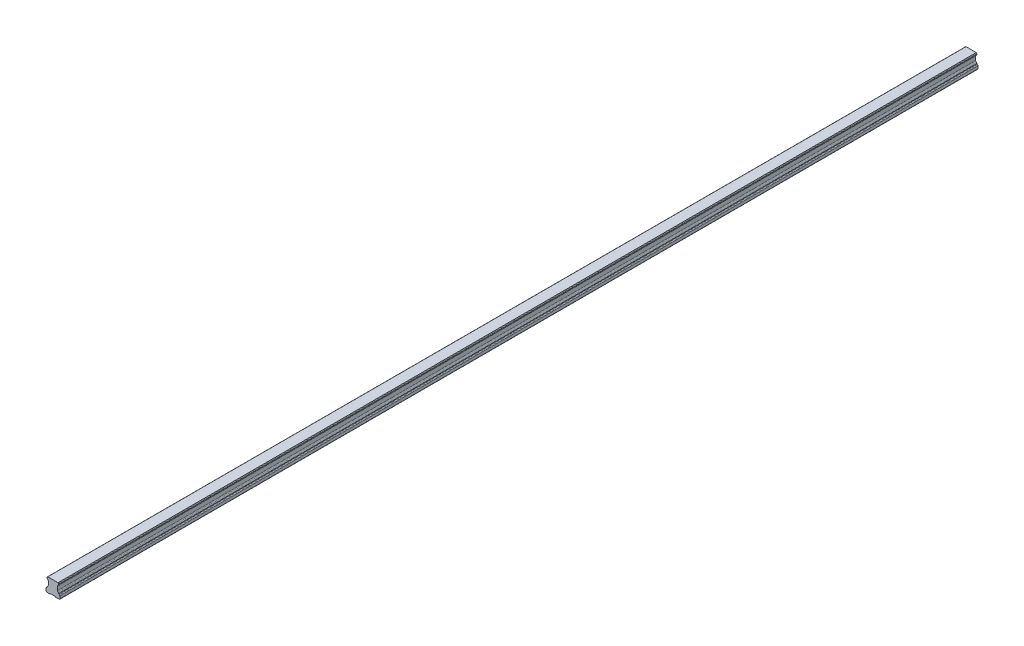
ISO-10303-21;
HEADER;
FILE_DESCRIPTION(('STEP AP214'),'2;1');
FILE_NAME('part.step','',(''),(''),'','','');
FILE_SCHEMA(('AUTOMOTIVE_DESIGN { 1 0 10303 214 1 1 1 1 }'));
ENDSEC;
DATA;
#1=APPLICATION_CONTEXT('core data for automotive mechanical design processes');
#2=APPLICATION_PROTOCOL_DEFINITION('international standard','automotive_design',2000,#1);
#3=PRODUCT_CONTEXT('',#1,'mechanical');
#4=PRODUCT('Part','Part','',(#3));
#5=PRODUCT_RELATED_PRODUCT_CATEGORY('part','',(#4));
#6=PRODUCT_DEFINITION_FORMATION('','',#4);
#7=PRODUCT_DEFINITION_CONTEXT('part definition',#1,'design');
#8=PRODUCT_DEFINITION('design','',#6,#7);
#9=PRODUCT_DEFINITION_SHAPE('','',#8);
#10=(LENGTH_UNIT() NAMED_UNIT(*) SI_UNIT(.MILLI.,.METRE.));
#11=(NAMED_UNIT(*) PLANE_ANGLE_UNIT() SI_UNIT($,.RADIAN.));
#12=(NAMED_UNIT(*) SI_UNIT($,.STERADIAN.) SOLID_ANGLE_UNIT());
#13=UNCERTAINTY_MEASURE_WITH_UNIT(LENGTH_MEASURE(1.E-05),#10,'distance_accuracy_value','');
#14=(GEOMETRIC_REPRESENTATION_CONTEXT(3) GLOBAL_UNCERTAINTY_ASSIGNED_CONTEXT((#13)) GLOBAL_UNIT_ASSIGNED_CONTEXT((#10,
#11,#12)) REPRESENTATION_CONTEXT('',''));
#15=CARTESIAN_POINT('',(0.,0.,0.));
#16=DIRECTION('',(0.,0.,1.));
#17=DIRECTION('',(1.,0.,0.));
#18=AXIS2_PLACEMENT_3D('',#15,#16,#17);
#19=CARTESIAN_POINT('',(6.84202014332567,-3.3,-1000.));
#20=DIRECTION('',(0.,-1.,0.));
#21=DIRECTION('',(1.,0.,0.));
#22=AXIS2_PLACEMENT_3D('',#19,#20,#21);
#23=PLANE('',#22);
#24=DIRECTION('',(0.,0.,1.));
#25=VECTOR('',#24,1.);
#26=CARTESIAN_POINT('',(3.,-3.3,-1000.));
#27=LINE('',#26,#25);
#28=CARTESIAN_POINT('',(3.,-3.3,-1000.));
#29=VERTEX_POINT('',#28);
#30=CARTESIAN_POINT('',(3.,-3.3,0.));
#31=VERTEX_POINT('',#30);
#32=EDGE_CURVE('E269',#29,#31,#27,.T.);
#33=ORIENTED_EDGE('',*,*,#32,.F.);
#34=DIRECTION('',(1.,0.,0.));
#35=VECTOR('',#34,1.);
#36=CARTESIAN_POINT('',(-6.84202014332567,-3.3,-1000.));
#37=LINE('',#36,#35);
#38=CARTESIAN_POINT('',(6.84202014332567,-3.3,-1000.));
#39=VERTEX_POINT('',#38);
#40=EDGE_CURVE('E460',#29,#39,#37,.T.);
#41=ORIENTED_EDGE('',*,*,#40,.T.);
#42=DIRECTION('',(0.,0.,1.));
#43=VECTOR('',#42,1.);
#44=CARTESIAN_POINT('',(6.84202014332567,-3.3,-1000.));
#45=LINE('',#44,#43);
#46=CARTESIAN_POINT('',(6.84202014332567,-3.3,0.));
#47=VERTEX_POINT('',#46);
#48=EDGE_CURVE('E368',#39,#47,#45,.T.);
#49=ORIENTED_EDGE('',*,*,#48,.T.);
#50=DIRECTION('',(1.,0.,0.));
#51=VECTOR('',#50,1.);
#52=CARTESIAN_POINT('',(6.84202014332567,-3.3,0.));
#53=LINE('',#52,#51);
#54=EDGE_CURVE('E311',#31,#47,#53,.T.);
#55=ORIENTED_EDGE('',*,*,#54,.F.);
#56=EDGE_LOOP('',(#33,#41,#49,#55));
#57=FACE_BOUND('',#56,.T.);
#58=ADVANCED_FACE('F33',(#57),#23,.T.);
#59=CARTESIAN_POINT('',(5.75000000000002,11.6,-1000.));
#60=DIRECTION('',(0.500000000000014,0.866025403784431,0.));
#61=DIRECTION('',(-0.866025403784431,0.500000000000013,0.));
#62=AXIS2_PLACEMENT_3D('',#59,#60,#61);
#63=PLANE('',#62);
#64=DIRECTION('',(-0.866025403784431,0.500000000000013,0.));
#65=VECTOR('',#64,1.);
#66=CARTESIAN_POINT('',(5.75000000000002,11.6,0.));
#67=LINE('',#66,#65);
#68=CARTESIAN_POINT('',(5.75000000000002,11.6,0.));
#69=VERTEX_POINT('',#68);
#70=CARTESIAN_POINT('',(5.57679491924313,11.7,0.));
#71=VERTEX_POINT('',#70);
#72=EDGE_CURVE('E265',#69,#71,#67,.T.);
#73=ORIENTED_EDGE('',*,*,#72,.F.);
#74=DIRECTION('',(0.,0.,1.));
#75=VECTOR('',#74,1.);
#76=CARTESIAN_POINT('',(5.75000000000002,11.6,-1000.));
#77=LINE('',#76,#75);
#78=CARTESIAN_POINT('',(5.75000000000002,11.6,-1000.));
#79=VERTEX_POINT('',#78);
#80=EDGE_CURVE('E11',#79,#69,#77,.T.);
#81=ORIENTED_EDGE('',*,*,#80,.F.);
#82=DIRECTION('',(-0.866025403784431,0.500000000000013,0.));
#83=VECTOR('',#82,1.);
#84=CARTESIAN_POINT('',(5.75000000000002,11.6,-1000.));
#85=LINE('',#84,#83);
#86=CARTESIAN_POINT('',(5.57679491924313,11.7,-1000.));
#87=VERTEX_POINT('',#86);
#88=EDGE_CURVE('E347',#79,#87,#85,.T.);
#89=ORIENTED_EDGE('',*,*,#88,.T.);
#90=DIRECTION('',(0.,0.,1.));
#91=VECTOR('',#90,1.);
#92=CARTESIAN_POINT('',(5.57679491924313,11.7,-1000.));
#93=LINE('',#92,#91);
#94=EDGE_CURVE('E37',#87,#71,#93,.T.);
#95=ORIENTED_EDGE('',*,*,#94,.T.);
#96=EDGE_LOOP('',(#73,#81,#89,#95));
#97=FACE_BOUND('',#96,.T.);
#98=ADVANCED_FACE('F35',(#97),#63,.T.);
#99=CARTESIAN_POINT('',(5.25,10.7339745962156,-1000.));
#100=DIRECTION('',(0.,0.,1.));
#101=DIRECTION('',(1.,0.,0.));
#102=AXIS2_PLACEMENT_3D('',#99,#100,#101);
#103=CYLINDRICAL_SURFACE('',#102,1.);
#104=CARTESIAN_POINT('',(5.25,10.7339745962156,0.));
#105=DIRECTION('',(0.,0.,1.));
#106=DIRECTION('',(1.,0.,0.));
#107=AXIS2_PLACEMENT_3D('',#104,#105,#106);
#108=CIRCLE('',#107,1.);
#109=CARTESIAN_POINT('',(6.25,10.7339745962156,0.));
#110=VERTEX_POINT('',#109);
#111=EDGE_CURVE('E345',#110,#69,#108,.T.);
#112=ORIENTED_EDGE('',*,*,#111,.F.);
#113=DIRECTION('',(0.,0.,1.));
#114=VECTOR('',#113,1.);
#115=CARTESIAN_POINT('',(6.25,10.7339745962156,-1000.));
#116=LINE('',#115,#114);
#117=CARTESIAN_POINT('',(6.25,10.7339745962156,-1000.));
#118=VERTEX_POINT('',#117);
#119=EDGE_CURVE('E42',#118,#110,#116,.T.);
#120=ORIENTED_EDGE('',*,*,#119,.F.);
#121=CARTESIAN_POINT('',(5.25,10.7339745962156,-1000.));
#122=DIRECTION('',(0.,0.,1.));
#123=DIRECTION('',(1.,0.,0.));
#124=AXIS2_PLACEMENT_3D('',#121,#122,#123);
#125=CIRCLE('',#124,1.);
#126=EDGE_CURVE('E255',#118,#79,#125,.T.);
#127=ORIENTED_EDGE('',*,*,#126,.T.);
#128=ORIENTED_EDGE('',*,*,#80,.T.);
#129=EDGE_LOOP('',(#112,#120,#127,#128));
#130=FACE_BOUND('',#129,.T.);
#131=ADVANCED_FACE('F404',(#130),#103,.T.);
#132=CARTESIAN_POINT('',(6.25,10.2339745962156,-1000.));
#133=DIRECTION('',(1.,0.,0.));
#134=DIRECTION('',(0.,1.,0.));
#135=AXIS2_PLACEMENT_3D('',#132,#133,#134);
#136=PLANE('',#135);
#137=DIRECTION('',(0.,1.,0.));
#138=VECTOR('',#137,1.);
#139=CARTESIAN_POINT('',(6.25,10.2339745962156,0.));
#140=LINE('',#139,#138);
#141=CARTESIAN_POINT('',(6.25,10.2339745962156,0.));
#142=VERTEX_POINT('',#141);
#143=EDGE_CURVE('E241',#142,#110,#140,.T.);
#144=ORIENTED_EDGE('',*,*,#143,.F.);
#145=DIRECTION('',(0.,0.,1.));
#146=VECTOR('',#145,1.);
#147=CARTESIAN_POINT('',(6.25,10.2339745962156,-1000.));
#148=LINE('',#147,#146);
#149=CARTESIAN_POINT('',(6.25,10.2339745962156,-1000.));
#150=VERTEX_POINT('',#149);
#151=EDGE_CURVE('E235',#150,#142,#148,.T.);
#152=ORIENTED_EDGE('',*,*,#151,.F.);
#153=DIRECTION('',(0.,1.,0.));
#154=VECTOR('',#153,1.);
#155=CARTESIAN_POINT('',(6.25,10.2339745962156,-1000.));
#156=LINE('',#155,#154);
#157=EDGE_CURVE('E238',#150,#118,#156,.T.);
#158=ORIENTED_EDGE('',*,*,#157,.T.);
#159=ORIENTED_EDGE('',*,*,#119,.T.);
#160=EDGE_LOOP('',(#144,#152,#158,#159));
#161=FACE_BOUND('',#160,.T.);
#162=ADVANCED_FACE('F237',(#161),#136,.T.);
#163=CARTESIAN_POINT('',(5.25,10.2339745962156,-1000.));
#164=DIRECTION('',(0.,0.,1.));
#165=DIRECTION('',(1.,0.,0.));
#166=AXIS2_PLACEMENT_3D('',#163,#164,#165);
#167=CYLINDRICAL_SURFACE('',#166,1.);
#168=CARTESIAN_POINT('',(5.25,10.2339745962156,0.));
#169=DIRECTION('',(0.,0.,1.));
#170=DIRECTION('',(1.,0.,0.));
#171=AXIS2_PLACEMENT_3D('',#168,#169,#170);
#172=CIRCLE('',#171,1.);
#173=CARTESIAN_POINT('',(5.69444444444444,9.33816817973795,0.));
#174=VERTEX_POINT('',#173);
#175=EDGE_CURVE('E342',#174,#142,#172,.T.);
#176=ORIENTED_EDGE('',*,*,#175,.F.);
#177=DIRECTION('',(0.,0.,1.));
#178=VECTOR('',#177,1.);
#179=CARTESIAN_POINT('',(5.69444444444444,9.33816817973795,-1000.));
#180=LINE('',#179,#178);
#181=CARTESIAN_POINT('',(5.69444444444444,9.33816817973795,-1000.));
#182=VERTEX_POINT('',#181);
#183=EDGE_CURVE('E246',#182,#174,#180,.T.);
#184=ORIENTED_EDGE('',*,*,#183,.F.);
#185=CARTESIAN_POINT('',(5.25,10.2339745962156,-1000.));
#186=DIRECTION('',(0.,0.,1.));
#187=DIRECTION('',(1.,0.,0.));
#188=AXIS2_PLACEMENT_3D('',#185,#186,#187);
#189=CIRCLE('',#188,1.);
#190=EDGE_CURVE('E253',#182,#150,#189,.T.);
#191=ORIENTED_EDGE('',*,*,#190,.T.);
#192=ORIENTED_EDGE('',*,*,#151,.T.);
#193=EDGE_LOOP('',(#176,#184,#191,#192));
#194=FACE_BOUND('',#193,.T.);
#195=ADVANCED_FACE('F257',(#194),#167,.T.);
#196=CARTESIAN_POINT('',(6.25,8.21841015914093,-1000.));
#197=DIRECTION('',(0.,0.,1.));
#198=DIRECTION('',(1.,0.,0.));
#199=AXIS2_PLACEMENT_3D('',#196,#197,#198);
#200=CYLINDRICAL_SURFACE('',#199,1.25);
#201=CARTESIAN_POINT('',(6.25,8.21841015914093,0.));
#202=DIRECTION('',(0.,0.,-1.));
#203=DIRECTION('',(1.,0.,0.));
#204=AXIS2_PLACEMENT_3D('',#201,#202,#203);
#205=CIRCLE('',#204,1.25);
#206=CARTESIAN_POINT('',(5.,8.21841015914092,0.));
#207=VERTEX_POINT('',#206);
#208=EDGE_CURVE('E339',#207,#174,#205,.T.);
#209=ORIENTED_EDGE('',*,*,#208,.F.);
#210=DIRECTION('',(0.,0.,1.));
#211=VECTOR('',#210,1.);
#212=CARTESIAN_POINT('',(5.,8.21841015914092,-1000.));
#213=LINE('',#212,#211);
#214=CARTESIAN_POINT('',(5.,8.21841015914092,-1000.));
#215=VERTEX_POINT('',#214);
#216=EDGE_CURVE('E351',#215,#207,#213,.T.);
#217=ORIENTED_EDGE('',*,*,#216,.F.);
#218=CARTESIAN_POINT('',(6.25,8.21841015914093,-1000.));
#219=DIRECTION('',(0.,0.,-1.));
#220=DIRECTION('',(1.,0.,0.));
#221=AXIS2_PLACEMENT_3D('',#218,#219,#220);
#222=CIRCLE('',#221,1.25);
#223=EDGE_CURVE('E258',#215,#182,#222,.T.);
#224=ORIENTED_EDGE('',*,*,#223,.T.);
#225=ORIENTED_EDGE('',*,*,#183,.T.);
#226=EDGE_LOOP('',(#209,#217,#224,#225));
#227=FACE_BOUND('',#226,.T.);
#228=ADVANCED_FACE('F852',(#227),#200,.F.);
#229=CARTESIAN_POINT('',(5.,4.02023384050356,-1000.));
#230=DIRECTION('',(1.,0.,0.));
#231=DIRECTION('',(0.,0.,-1.));
#232=AXIS2_PLACEMENT_3D('',#229,#230,#231);
#233=PLANE('',#232);
#234=DIRECTION('',(0.,1.,0.));
#235=VECTOR('',#234,1.);
#236=CARTESIAN_POINT('',(5.,4.02023384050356,0.));
#237=LINE('',#236,#235);
#238=CARTESIAN_POINT('',(5.,4.02023384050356,0.));
#239=VERTEX_POINT('',#238);
#240=EDGE_CURVE('E336',#239,#207,#237,.T.);
#241=ORIENTED_EDGE('',*,*,#240,.F.);
#242=DIRECTION('',(0.,0.,1.));
#243=VECTOR('',#242,1.);
#244=CARTESIAN_POINT('',(5.,4.02023384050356,-1000.));
#245=LINE('',#244,#243);
#246=CARTESIAN_POINT('',(5.,4.02023384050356,-1000.));
#247=VERTEX_POINT('',#246);
#248=EDGE_CURVE('E353',#247,#239,#245,.T.);
#249=ORIENTED_EDGE('',*,*,#248,.F.);
#250=DIRECTION('',(0.,1.,0.));
#251=VECTOR('',#250,1.);
#252=CARTESIAN_POINT('',(5.,4.02023384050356,-1000.));
#253=LINE('',#252,#251);
#254=EDGE_CURVE('E260',#247,#215,#253,.T.);
#255=ORIENTED_EDGE('',*,*,#254,.T.);
#256=ORIENTED_EDGE('',*,*,#216,.T.);
#257=EDGE_LOOP('',(#241,#249,#255,#256));
#258=FACE_BOUND('',#257,.T.);
#259=ADVANCED_FACE('F487',(#258),#233,.T.);
#260=CARTESIAN_POINT('',(6.25,4.02023384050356,-1000.));
#261=DIRECTION('',(0.,0.,1.));
#262=DIRECTION('',(1.,0.,0.));
#263=AXIS2_PLACEMENT_3D('',#260,#261,#262);
#264=CYLINDRICAL_SURFACE('',#263,1.25);
#265=CARTESIAN_POINT('',(6.25,4.02023384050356,0.));
#266=DIRECTION('',(0.,0.,-1.));
#267=DIRECTION('',(1.,0.,0.));
#268=AXIS2_PLACEMENT_3D('',#265,#266,#267);
#269=CIRCLE('',#268,1.25);
#270=CARTESIAN_POINT('',(5.625,2.93770208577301,0.));
#271=VERTEX_POINT('',#270);
#272=EDGE_CURVE('E333',#271,#239,#269,.T.);
#273=ORIENTED_EDGE('',*,*,#272,.F.);
#274=DIRECTION('',(0.,0.,1.));
#275=VECTOR('',#274,1.);
#276=CARTESIAN_POINT('',(5.625,2.93770208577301,-1000.));
#277=LINE('',#276,#275);
#278=CARTESIAN_POINT('',(5.625,2.93770208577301,-1000.));
#279=VERTEX_POINT('',#278);
#280=EDGE_CURVE('E355',#279,#271,#277,.T.);
#281=ORIENTED_EDGE('',*,*,#280,.F.);
#282=CARTESIAN_POINT('',(6.25,4.02023384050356,-1000.));
#283=DIRECTION('',(0.,0.,-1.));
#284=DIRECTION('',(1.,0.,0.));
#285=AXIS2_PLACEMENT_3D('',#282,#283,#284);
#286=CIRCLE('',#285,1.25);
#287=EDGE_CURVE('E481',#279,#247,#286,.T.);
#288=ORIENTED_EDGE('',*,*,#287,.T.);
#289=ORIENTED_EDGE('',*,*,#248,.T.);
#290=EDGE_LOOP('',(#273,#281,#288,#289));
#291=FACE_BOUND('',#290,.T.);
#292=ADVANCED_FACE('F493',(#291),#264,.F.);
#293=CARTESIAN_POINT('',(5.,1.85517033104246,-1000.));
#294=DIRECTION('',(0.,0.,1.));
#295=DIRECTION('',(1.,0.,0.));
#296=AXIS2_PLACEMENT_3D('',#293,#294,#295);
#297=CYLINDRICAL_SURFACE('',#296,1.25);
#298=CARTESIAN_POINT('',(5.,1.85517033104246,0.));
#299=DIRECTION('',(0.,0.,1.));
#300=DIRECTION('',(1.,0.,0.));
#301=AXIS2_PLACEMENT_3D('',#298,#299,#300);
#302=CIRCLE('',#301,1.25);
#303=CARTESIAN_POINT('',(6.25,1.85517033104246,0.));
#304=VERTEX_POINT('',#303);
#305=EDGE_CURVE('E330',#304,#271,#302,.T.);
#306=ORIENTED_EDGE('',*,*,#305,.F.);
#307=DIRECTION('',(0.,0.,1.));
#308=VECTOR('',#307,1.);
#309=CARTESIAN_POINT('',(6.25,1.85517033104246,-1000.));
#310=LINE('',#309,#308);
#311=CARTESIAN_POINT('',(6.25,1.85517033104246,-1000.));
#312=VERTEX_POINT('',#311);
#313=EDGE_CURVE('E357',#312,#304,#310,.T.);
#314=ORIENTED_EDGE('',*,*,#313,.F.);
#315=CARTESIAN_POINT('',(5.,1.85517033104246,-1000.));
#316=DIRECTION('',(0.,0.,1.));
#317=DIRECTION('',(1.,0.,0.));
#318=AXIS2_PLACEMENT_3D('',#315,#316,#317);
#319=CIRCLE('',#318,1.25);
#320=EDGE_CURVE('E478',#312,#279,#319,.T.);
#321=ORIENTED_EDGE('',*,*,#320,.T.);
#322=ORIENTED_EDGE('',*,*,#280,.T.);
#323=EDGE_LOOP('',(#306,#314,#321,#322));
#324=FACE_BOUND('',#323,.T.);
#325=ADVANCED_FACE('F496',(#324),#297,.T.);
#326=CARTESIAN_POINT('',(6.25,1.35517033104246,-1000.));
#327=DIRECTION('',(1.,0.,0.));
#328=DIRECTION('',(0.,0.,-1.));
#329=AXIS2_PLACEMENT_3D('',#326,#327,#328);
#330=PLANE('',#329);
#331=DIRECTION('',(0.,1.,0.));
#332=VECTOR('',#331,1.);
#333=CARTESIAN_POINT('',(6.25,1.35517033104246,0.));
#334=LINE('',#333,#332);
#335=CARTESIAN_POINT('',(6.25,1.35517033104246,0.));
#336=VERTEX_POINT('',#335);
#337=EDGE_CURVE('E327',#336,#304,#334,.T.);
#338=ORIENTED_EDGE('',*,*,#337,.F.);
#339=DIRECTION('',(0.,0.,1.));
#340=VECTOR('',#339,1.);
#341=CARTESIAN_POINT('',(6.25,1.35517033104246,-1000.));
#342=LINE('',#341,#340);
#343=CARTESIAN_POINT('',(6.25,1.35517033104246,-1000.));
#344=VERTEX_POINT('',#343);
#345=EDGE_CURVE('E359',#344,#336,#342,.T.);
#346=ORIENTED_EDGE('',*,*,#345,.F.);
#347=DIRECTION('',(0.,1.,0.));
#348=VECTOR('',#347,1.);
#349=CARTESIAN_POINT('',(6.25,1.35517033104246,-1000.));
#350=LINE('',#349,#348);
#351=EDGE_CURVE('E475',#344,#312,#350,.T.);
#352=ORIENTED_EDGE('',*,*,#351,.T.);
#353=ORIENTED_EDGE('',*,*,#313,.T.);
#354=EDGE_LOOP('',(#338,#346,#352,#353));
#355=FACE_BOUND('',#354,.T.);
#356=ADVANCED_FACE('F501',(#355),#330,.T.);
#357=CARTESIAN_POINT('',(6.84202014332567,1.13969262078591,-1000.));
#358=DIRECTION('',(0.342020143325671,0.939692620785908,0.));
#359=DIRECTION('',(-0.939692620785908,0.342020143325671,0.));
#360=AXIS2_PLACEMENT_3D('',#357,#358,#359);
#361=PLANE('',#360);
#362=DIRECTION('',(-0.939692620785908,0.342020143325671,0.));
#363=VECTOR('',#362,1.);
#364=CARTESIAN_POINT('',(6.84202014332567,1.13969262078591,0.));
#365=LINE('',#364,#363);
#366=CARTESIAN_POINT('',(6.84202014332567,1.13969262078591,0.));
#367=VERTEX_POINT('',#366);
#368=EDGE_CURVE('E324',#367,#336,#365,.T.);
#369=ORIENTED_EDGE('',*,*,#368,.F.);
#370=DIRECTION('',(0.,0.,1.));
#371=VECTOR('',#370,1.);
#372=CARTESIAN_POINT('',(6.84202014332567,1.13969262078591,-1000.));
#373=LINE('',#372,#371);
#374=CARTESIAN_POINT('',(6.84202014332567,1.13969262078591,-1000.));
#375=VERTEX_POINT('',#374);
#376=EDGE_CURVE('E361',#375,#367,#373,.T.);
#377=ORIENTED_EDGE('',*,*,#376,.F.);
#378=DIRECTION('',(-0.939692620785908,0.342020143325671,0.));
#379=VECTOR('',#378,1.);
#380=CARTESIAN_POINT('',(6.84202014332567,1.13969262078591,-1000.));
#381=LINE('',#380,#379);
#382=EDGE_CURVE('E472',#375,#344,#381,.T.);
#383=ORIENTED_EDGE('',*,*,#382,.T.);
#384=ORIENTED_EDGE('',*,*,#345,.T.);
#385=EDGE_LOOP('',(#369,#377,#383,#384));
#386=FACE_BOUND('',#385,.T.);
#387=ADVANCED_FACE('F504',(#386),#361,.T.);
#388=CARTESIAN_POINT('',(6.5,0.2,-1000.));
#389=DIRECTION('',(0.,0.,1.));
#390=DIRECTION('',(1.,0.,0.));
#391=AXIS2_PLACEMENT_3D('',#388,#389,#390);
#392=CYLINDRICAL_SURFACE('',#391,1.);
#393=CARTESIAN_POINT('',(6.5,0.2,0.));
#394=DIRECTION('',(0.,0.,1.));
#395=DIRECTION('',(1.,0.,0.));
#396=AXIS2_PLACEMENT_3D('',#393,#394,#395);
#397=CIRCLE('',#396,1.);
#398=CARTESIAN_POINT('',(7.5,0.2,0.));
#399=VERTEX_POINT('',#398);
#400=EDGE_CURVE('E321',#399,#367,#397,.T.);
#401=ORIENTED_EDGE('',*,*,#400,.F.);
#402=DIRECTION('',(0.,0.,1.));
#403=VECTOR('',#402,1.);
#404=CARTESIAN_POINT('',(7.5,0.2,-1000.));
#405=LINE('',#404,#403);
#406=CARTESIAN_POINT('',(7.5,0.2,-1000.));
#407=VERTEX_POINT('',#406);
#408=EDGE_CURVE('E363',#407,#399,#405,.T.);
#409=ORIENTED_EDGE('',*,*,#408,.F.);
#410=CARTESIAN_POINT('',(6.5,0.2,-1000.));
#411=DIRECTION('',(0.,0.,1.));
#412=DIRECTION('',(1.,0.,0.));
#413=AXIS2_PLACEMENT_3D('',#410,#411,#412);
#414=CIRCLE('',#413,1.);
#415=EDGE_CURVE('E469',#407,#375,#414,.T.);
#416=ORIENTED_EDGE('',*,*,#415,.T.);
#417=ORIENTED_EDGE('',*,*,#376,.T.);
#418=EDGE_LOOP('',(#401,#409,#416,#417));
#419=FACE_BOUND('',#418,.T.);
#420=ADVANCED_FACE('F510',(#419),#392,.T.);
#421=CARTESIAN_POINT('',(7.5,0.,-1000.));
#422=DIRECTION('',(1.,0.,0.));
#423=DIRECTION('',(0.,1.,0.));
#424=AXIS2_PLACEMENT_3D('',#421,#422,#423);
#425=PLANE('',#424);
#426=DIRECTION('',(0.,1.,0.));
#427=VECTOR('',#426,1.);
#428=CARTESIAN_POINT('',(7.5,0.,0.));
#429=LINE('',#428,#427);
#430=CARTESIAN_POINT('',(7.5,-2.64202014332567,0.));
#431=VERTEX_POINT('',#430);
#432=EDGE_CURVE('E318',#431,#399,#429,.T.);
#433=ORIENTED_EDGE('',*,*,#432,.F.);
#434=DIRECTION('',(0.,0.,1.));
#435=VECTOR('',#434,1.);
#436=CARTESIAN_POINT('',(7.5,-2.64202014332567,-1000.));
#437=LINE('',#436,#435);
#438=CARTESIAN_POINT('',(7.5,-2.64202014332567,-1000.));
#439=VERTEX_POINT('',#438);
#440=EDGE_CURVE('E365',#439,#431,#437,.T.);
#441=ORIENTED_EDGE('',*,*,#440,.F.);
#442=DIRECTION('',(0.,1.,0.));
#443=VECTOR('',#442,1.);
#444=CARTESIAN_POINT('',(7.5,0.,-1000.));
#445=LINE('',#444,#443);
#446=EDGE_CURVE('E463',#439,#407,#445,.T.);
#447=ORIENTED_EDGE('',*,*,#446,.T.);
#448=ORIENTED_EDGE('',*,*,#408,.T.);
#449=EDGE_LOOP('',(#433,#441,#447,#448));
#450=FACE_BOUND('',#449,.T.);
#451=ADVANCED_FACE('F432',(#450),#425,.T.);
#452=CARTESIAN_POINT('',(6.84202014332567,-2.64202014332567,-1000.));
#453=DIRECTION('',(0.,0.,1.));
#454=DIRECTION('',(1.,0.,0.));
#455=AXIS2_PLACEMENT_3D('',#452,#453,#454);
#456=CYLINDRICAL_SURFACE('',#455,0.657979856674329);
#457=CARTESIAN_POINT('',(6.84202014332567,-2.64202014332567,0.));
#458=DIRECTION('',(0.,0.,1.));
#459=DIRECTION('',(1.,0.,0.));
#460=AXIS2_PLACEMENT_3D('',#457,#458,#459);
#461=CIRCLE('',#460,0.657979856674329);
#462=EDGE_CURVE('E315',#47,#431,#461,.T.);
#463=ORIENTED_EDGE('',*,*,#462,.F.);
#464=ORIENTED_EDGE('',*,*,#48,.F.);
#465=CARTESIAN_POINT('',(6.84202014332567,-2.64202014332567,-1000.));
#466=DIRECTION('',(0.,0.,1.));
#467=DIRECTION('',(1.,0.,0.));
#468=AXIS2_PLACEMENT_3D('',#465,#466,#467);
#469=CIRCLE('',#468,0.657979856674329);
#470=EDGE_CURVE('E459',#39,#439,#469,.T.);
#471=ORIENTED_EDGE('',*,*,#470,.T.);
#472=ORIENTED_EDGE('',*,*,#440,.T.);
#473=EDGE_LOOP('',(#463,#464,#471,#472));
#474=FACE_BOUND('',#473,.T.);
#475=ADVANCED_FACE('F424',(#474),#456,.T.);
#476=DIRECTION('',(0.,0.,1.));
#477=VECTOR('',#476,1.);
#478=CARTESIAN_POINT('',(-3.,-3.30000000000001,-1000.));
#479=LINE('',#478,#477);
#480=CARTESIAN_POINT('',(-3.,-3.30000000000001,-1000.));
#481=VERTEX_POINT('',#480);
#482=CARTESIAN_POINT('',(-3.,-3.30000000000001,0.));
#483=VERTEX_POINT('',#482);
#484=EDGE_CURVE('E438',#481,#483,#479,.T.);
#485=ORIENTED_EDGE('',*,*,#484,.T.);
#486=CARTESIAN_POINT('',(-6.84202014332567,-3.3,0.));
#487=VERTEX_POINT('',#486);
#488=EDGE_CURVE('E312',#487,#483,#53,.T.);
#489=ORIENTED_EDGE('',*,*,#488,.F.);
#490=DIRECTION('',(0.,0.,1.));
#491=VECTOR('',#490,1.);
#492=CARTESIAN_POINT('',(-6.84202014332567,-3.3,-1000.));
#493=LINE('',#492,#491);
#494=CARTESIAN_POINT('',(-6.84202014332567,-3.3,-1000.));
#495=VERTEX_POINT('',#494);
#496=EDGE_CURVE('E371',#495,#487,#493,.T.);
#497=ORIENTED_EDGE('',*,*,#496,.F.);
#498=EDGE_CURVE('E441',#495,#481,#37,.T.);
#499=ORIENTED_EDGE('',*,*,#498,.T.);
#500=EDGE_LOOP('',(#485,#489,#497,#499));
#501=FACE_BOUND('',#500,.T.);
#502=ADVANCED_FACE('F416',(#501),#23,.T.);
#503=CARTESIAN_POINT('',(-6.84202014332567,-2.64202014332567,-1000.));
#504=DIRECTION('',(0.,0.,1.));
#505=DIRECTION('',(1.,0.,0.));
#506=AXIS2_PLACEMENT_3D('',#503,#504,#505);
#507=CYLINDRICAL_SURFACE('',#506,0.657979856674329);
#508=CARTESIAN_POINT('',(-6.84202014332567,-2.64202014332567,0.));
#509=DIRECTION('',(0.,0.,1.));
#510=DIRECTION('',(-1.,0.,0.));
#511=AXIS2_PLACEMENT_3D('',#508,#509,#510);
#512=CIRCLE('',#511,0.657979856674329);
#513=CARTESIAN_POINT('',(-7.5,-2.64202014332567,0.));
#514=VERTEX_POINT('',#513);
#515=EDGE_CURVE('E308',#514,#487,#512,.T.);
#516=ORIENTED_EDGE('',*,*,#515,.F.);
#517=DIRECTION('',(0.,0.,1.));
#518=VECTOR('',#517,1.);
#519=CARTESIAN_POINT('',(-7.5,-2.64202014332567,-1000.));
#520=LINE('',#519,#518);
#521=CARTESIAN_POINT('',(-7.5,-2.64202014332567,-1000.));
#522=VERTEX_POINT('',#521);
#523=EDGE_CURVE('E374',#522,#514,#520,.T.);
#524=ORIENTED_EDGE('',*,*,#523,.F.);
#525=CARTESIAN_POINT('',(-6.84202014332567,-2.64202014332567,-1000.));
#526=DIRECTION('',(0.,0.,1.));
#527=DIRECTION('',(-1.,0.,0.));
#528=AXIS2_PLACEMENT_3D('',#525,#526,#527);
#529=CIRCLE('',#528,0.657979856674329);
#530=EDGE_CURVE('E455',#522,#495,#529,.T.);
#531=ORIENTED_EDGE('',*,*,#530,.T.);
#532=ORIENTED_EDGE('',*,*,#496,.T.);
#533=EDGE_LOOP('',(#516,#524,#531,#532));
#534=FACE_BOUND('',#533,.T.);
#535=ADVANCED_FACE('F423',(#534),#507,.T.);
#536=CARTESIAN_POINT('',(-7.5,0.,-1000.));
#537=DIRECTION('',(-1.,0.,0.));
#538=DIRECTION('',(0.,-1.,0.));
#539=AXIS2_PLACEMENT_3D('',#536,#537,#538);
#540=PLANE('',#539);
#541=DIRECTION('',(0.,-1.,0.));
#542=VECTOR('',#541,1.);
#543=CARTESIAN_POINT('',(-7.5,0.,0.));
#544=LINE('',#543,#542);
#545=CARTESIAN_POINT('',(-7.5,0.199999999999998,0.));
#546=VERTEX_POINT('',#545);
#547=EDGE_CURVE('E305',#546,#514,#544,.T.);
#548=ORIENTED_EDGE('',*,*,#547,.F.);
#549=DIRECTION('',(0.,0.,1.));
#550=VECTOR('',#549,1.);
#551=CARTESIAN_POINT('',(-7.5,0.199999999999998,-1000.));
#552=LINE('',#551,#550);
#553=CARTESIAN_POINT('',(-7.5,0.199999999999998,-1000.));
#554=VERTEX_POINT('',#553);
#555=EDGE_CURVE('E376',#554,#546,#552,.T.);
#556=ORIENTED_EDGE('',*,*,#555,.F.);
#557=DIRECTION('',(0.,-1.,0.));
#558=VECTOR('',#557,1.);
#559=CARTESIAN_POINT('',(-7.5,0.,-1000.));
#560=LINE('',#559,#558);
#561=EDGE_CURVE('E577',#554,#522,#560,.T.);
#562=ORIENTED_EDGE('',*,*,#561,.T.);
#563=ORIENTED_EDGE('',*,*,#523,.T.);
#564=EDGE_LOOP('',(#548,#556,#562,#563));
#565=FACE_BOUND('',#564,.T.);
#566=ADVANCED_FACE('F430',(#565),#540,.T.);
#567=CARTESIAN_POINT('',(-6.5,0.199999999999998,-1000.));
#568=DIRECTION('',(0.,0.,1.));
#569=DIRECTION('',(1.,0.,0.));
#570=AXIS2_PLACEMENT_3D('',#567,#568,#569);
#571=CYLINDRICAL_SURFACE('',#570,1.);
#572=CARTESIAN_POINT('',(-6.5,0.199999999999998,0.));
#573=DIRECTION('',(0.,0.,1.));
#574=DIRECTION('',(-1.,0.,0.));
#575=AXIS2_PLACEMENT_3D('',#572,#573,#574);
#576=CIRCLE('',#575,1.);
#577=CARTESIAN_POINT('',(-6.84202014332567,1.13969262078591,0.));
#578=VERTEX_POINT('',#577);
#579=EDGE_CURVE('E302',#578,#546,#576,.T.);
#580=ORIENTED_EDGE('',*,*,#579,.F.);
#581=DIRECTION('',(0.,0.,1.));
#582=VECTOR('',#581,1.);
#583=CARTESIAN_POINT('',(-6.84202014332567,1.13969262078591,-1000.));
#584=LINE('',#583,#582);
#585=CARTESIAN_POINT('',(-6.84202014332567,1.13969262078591,-1000.));
#586=VERTEX_POINT('',#585);
#587=EDGE_CURVE('E379',#586,#578,#584,.T.);
#588=ORIENTED_EDGE('',*,*,#587,.F.);
#589=CARTESIAN_POINT('',(-6.5,0.199999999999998,-1000.));
#590=DIRECTION('',(0.,0.,1.));
#591=DIRECTION('',(-1.,0.,0.));
#592=AXIS2_PLACEMENT_3D('',#589,#590,#591);
#593=CIRCLE('',#592,1.);
#594=EDGE_CURVE('E575',#586,#554,#593,.T.);
#595=ORIENTED_EDGE('',*,*,#594,.T.);
#596=ORIENTED_EDGE('',*,*,#555,.T.);
#597=EDGE_LOOP('',(#580,#588,#595,#596));
#598=FACE_BOUND('',#597,.T.);
#599=ADVANCED_FACE('F583',(#598),#571,.T.);
#600=CARTESIAN_POINT('',(-6.84202014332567,1.13969262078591,-1000.));
#601=DIRECTION('',(-0.342020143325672,0.939692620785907,0.));
#602=DIRECTION('',(-0.939692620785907,-0.342020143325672,0.));
#603=AXIS2_PLACEMENT_3D('',#600,#601,#602);
#604=PLANE('',#603);
#605=DIRECTION('',(-0.939692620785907,-0.342020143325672,0.));
#606=VECTOR('',#605,1.);
#607=CARTESIAN_POINT('',(-6.84202014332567,1.13969262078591,0.));
#608=LINE('',#607,#606);
#609=CARTESIAN_POINT('',(-6.25,1.35517033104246,0.));
#610=VERTEX_POINT('',#609);
#611=EDGE_CURVE('E299',#610,#578,#608,.T.);
#612=ORIENTED_EDGE('',*,*,#611,.F.);
#613=DIRECTION('',(0.,0.,1.));
#614=VECTOR('',#613,1.);
#615=CARTESIAN_POINT('',(-6.25,1.35517033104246,-1000.));
#616=LINE('',#615,#614);
#617=CARTESIAN_POINT('',(-6.25,1.35517033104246,-1000.));
#618=VERTEX_POINT('',#617);
#619=EDGE_CURVE('E381',#618,#610,#616,.T.);
#620=ORIENTED_EDGE('',*,*,#619,.F.);
#621=DIRECTION('',(-0.939692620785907,-0.342020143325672,0.));
#622=VECTOR('',#621,1.);
#623=CARTESIAN_POINT('',(-6.84202014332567,1.13969262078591,-1000.));
#624=LINE('',#623,#622);
#625=EDGE_CURVE('E572',#618,#586,#624,.T.);
#626=ORIENTED_EDGE('',*,*,#625,.T.);
#627=ORIENTED_EDGE('',*,*,#587,.T.);
#628=EDGE_LOOP('',(#612,#620,#626,#627));
#629=FACE_BOUND('',#628,.T.);
#630=ADVANCED_FACE('F586',(#629),#604,.T.);
#631=CARTESIAN_POINT('',(-6.25,1.35517033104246,-1000.));
#632=DIRECTION('',(-1.,0.,0.));
#633=DIRECTION('',(0.,0.,1.));
#634=AXIS2_PLACEMENT_3D('',#631,#632,#633);
#635=PLANE('',#634);
#636=DIRECTION('',(0.,-1.,0.));
#637=VECTOR('',#636,1.);
#638=CARTESIAN_POINT('',(-6.25,1.35517033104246,0.));
#639=LINE('',#638,#637);
#640=CARTESIAN_POINT('',(-6.25,1.85517033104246,0.));
#641=VERTEX_POINT('',#640);
#642=EDGE_CURVE('E296',#641,#610,#639,.T.);
#643=ORIENTED_EDGE('',*,*,#642,.F.);
#644=DIRECTION('',(0.,0.,1.));
#645=VECTOR('',#644,1.);
#646=CARTESIAN_POINT('',(-6.25,1.85517033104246,-1000.));
#647=LINE('',#646,#645);
#648=CARTESIAN_POINT('',(-6.25,1.85517033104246,-1000.));
#649=VERTEX_POINT('',#648);
#650=EDGE_CURVE('E383',#649,#641,#647,.T.);
#651=ORIENTED_EDGE('',*,*,#650,.F.);
#652=DIRECTION('',(0.,-1.,0.));
#653=VECTOR('',#652,1.);
#654=CARTESIAN_POINT('',(-6.25,1.35517033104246,-1000.));
#655=LINE('',#654,#653);
#656=EDGE_CURVE('E569',#649,#618,#655,.T.);
#657=ORIENTED_EDGE('',*,*,#656,.T.);
#658=ORIENTED_EDGE('',*,*,#619,.T.);
#659=EDGE_LOOP('',(#643,#651,#657,#658));
#660=FACE_BOUND('',#659,.T.);
#661=ADVANCED_FACE('F591',(#660),#635,.T.);
#662=CARTESIAN_POINT('',(-5.,1.85517033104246,-1000.));
#663=DIRECTION('',(0.,0.,1.));
#664=DIRECTION('',(1.,0.,0.));
#665=AXIS2_PLACEMENT_3D('',#662,#663,#664);
#666=CYLINDRICAL_SURFACE('',#665,1.25);
#667=CARTESIAN_POINT('',(-5.,1.85517033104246,0.));
#668=DIRECTION('',(0.,0.,1.));
#669=DIRECTION('',(-1.,0.,0.));
#670=AXIS2_PLACEMENT_3D('',#667,#668,#669);
#671=CIRCLE('',#670,1.25);
#672=CARTESIAN_POINT('',(-5.625,2.93770208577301,0.));
#673=VERTEX_POINT('',#672);
#674=EDGE_CURVE('E293',#673,#641,#671,.T.);
#675=ORIENTED_EDGE('',*,*,#674,.F.);
#676=DIRECTION('',(0.,0.,1.));
#677=VECTOR('',#676,1.);
#678=CARTESIAN_POINT('',(-5.625,2.93770208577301,-1000.));
#679=LINE('',#678,#677);
#680=CARTESIAN_POINT('',(-5.625,2.93770208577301,-1000.));
#681=VERTEX_POINT('',#680);
#682=EDGE_CURVE('E385',#681,#673,#679,.T.);
#683=ORIENTED_EDGE('',*,*,#682,.F.);
#684=CARTESIAN_POINT('',(-5.,1.85517033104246,-1000.));
#685=DIRECTION('',(0.,0.,1.));
#686=DIRECTION('',(-1.,0.,0.));
#687=AXIS2_PLACEMENT_3D('',#684,#685,#686);
#688=CIRCLE('',#687,1.25);
#689=EDGE_CURVE('E566',#681,#649,#688,.T.);
#690=ORIENTED_EDGE('',*,*,#689,.T.);
#691=ORIENTED_EDGE('',*,*,#650,.T.);
#692=EDGE_LOOP('',(#675,#683,#690,#691));
#693=FACE_BOUND('',#692,.T.);
#694=ADVANCED_FACE('F594',(#693),#666,.T.);
#695=CARTESIAN_POINT('',(-6.25,4.02023384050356,-1000.));
#696=DIRECTION('',(0.,0.,1.));
#697=DIRECTION('',(1.,0.,0.));
#698=AXIS2_PLACEMENT_3D('',#695,#696,#697);
#699=CYLINDRICAL_SURFACE('',#698,1.25);
#700=CARTESIAN_POINT('',(-6.25,4.02023384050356,0.));
#701=DIRECTION('',(0.,0.,-1.));
#702=DIRECTION('',(-1.,0.,0.));
#703=AXIS2_PLACEMENT_3D('',#700,#701,#702);
#704=CIRCLE('',#703,1.25);
#705=CARTESIAN_POINT('',(-5.,4.02023384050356,0.));
#706=VERTEX_POINT('',#705);
#707=EDGE_CURVE('E290',#706,#673,#704,.T.);
#708=ORIENTED_EDGE('',*,*,#707,.F.);
#709=DIRECTION('',(0.,0.,1.));
#710=VECTOR('',#709,1.);
#711=CARTESIAN_POINT('',(-5.,4.02023384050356,-1000.));
#712=LINE('',#711,#710);
#713=CARTESIAN_POINT('',(-5.,4.02023384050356,-1000.));
#714=VERTEX_POINT('',#713);
#715=EDGE_CURVE('E387',#714,#706,#712,.T.);
#716=ORIENTED_EDGE('',*,*,#715,.F.);
#717=CARTESIAN_POINT('',(-6.25,4.02023384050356,-1000.));
#718=DIRECTION('',(0.,0.,-1.));
#719=DIRECTION('',(-1.,0.,0.));
#720=AXIS2_PLACEMENT_3D('',#717,#718,#719);
#721=CIRCLE('',#720,1.25);
#722=EDGE_CURVE('E563',#714,#681,#721,.T.);
#723=ORIENTED_EDGE('',*,*,#722,.T.);
#724=ORIENTED_EDGE('',*,*,#682,.T.);
#725=EDGE_LOOP('',(#708,#716,#723,#724));
#726=FACE_BOUND('',#725,.T.);
#727=ADVANCED_FACE('F599',(#726),#699,.F.);
#728=CARTESIAN_POINT('',(-5.,4.02023384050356,-1000.));
#729=DIRECTION('',(-1.,0.,0.));
#730=DIRECTION('',(0.,0.,1.));
#731=AXIS2_PLACEMENT_3D('',#728,#729,#730);
#732=PLANE('',#731);
#733=DIRECTION('',(0.,-1.,0.));
#734=VECTOR('',#733,1.);
#735=CARTESIAN_POINT('',(-5.,4.02023384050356,0.));
#736=LINE('',#735,#734);
#737=CARTESIAN_POINT('',(-5.,8.21841015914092,0.));
#738=VERTEX_POINT('',#737);
#739=EDGE_CURVE('E287',#738,#706,#736,.T.);
#740=ORIENTED_EDGE('',*,*,#739,.F.);
#741=DIRECTION('',(0.,0.,1.));
#742=VECTOR('',#741,1.);
#743=CARTESIAN_POINT('',(-5.,8.21841015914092,-1000.));
#744=LINE('',#743,#742);
#745=CARTESIAN_POINT('',(-5.,8.21841015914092,-1000.));
#746=VERTEX_POINT('',#745);
#747=EDGE_CURVE('E389',#746,#738,#744,.T.);
#748=ORIENTED_EDGE('',*,*,#747,.F.);
#749=DIRECTION('',(0.,-1.,0.));
#750=VECTOR('',#749,1.);
#751=CARTESIAN_POINT('',(-5.,4.02023384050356,-1000.));
#752=LINE('',#751,#750);
#753=EDGE_CURVE('E560',#746,#714,#752,.T.);
#754=ORIENTED_EDGE('',*,*,#753,.T.);
#755=ORIENTED_EDGE('',*,*,#715,.T.);
#756=EDGE_LOOP('',(#740,#748,#754,#755));
#757=FACE_BOUND('',#756,.T.);
#758=ADVANCED_FACE('F602',(#757),#732,.T.);
#759=CARTESIAN_POINT('',(-6.25,8.21841015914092,-1000.));
#760=DIRECTION('',(0.,0.,1.));
#761=DIRECTION('',(1.,0.,0.));
#762=AXIS2_PLACEMENT_3D('',#759,#760,#761);
#763=CYLINDRICAL_SURFACE('',#762,1.25);
#764=CARTESIAN_POINT('',(-6.25,8.21841015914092,0.));
#765=DIRECTION('',(0.,0.,-1.));
#766=DIRECTION('',(-1.,0.,0.));
#767=AXIS2_PLACEMENT_3D('',#764,#765,#766);
#768=CIRCLE('',#767,1.25);
#769=CARTESIAN_POINT('',(-5.69444444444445,9.33816817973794,0.));
#770=VERTEX_POINT('',#769);
#771=EDGE_CURVE('E284',#770,#738,#768,.T.);
#772=ORIENTED_EDGE('',*,*,#771,.F.);
#773=DIRECTION('',(0.,0.,1.));
#774=VECTOR('',#773,1.);
#775=CARTESIAN_POINT('',(-5.69444444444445,9.33816817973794,-1000.));
#776=LINE('',#775,#774);
#777=CARTESIAN_POINT('',(-5.69444444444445,9.33816817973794,-1000.));
#778=VERTEX_POINT('',#777);
#779=EDGE_CURVE('E391',#778,#770,#776,.T.);
#780=ORIENTED_EDGE('',*,*,#779,.F.);
#781=CARTESIAN_POINT('',(-6.25,8.21841015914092,-1000.));
#782=DIRECTION('',(0.,0.,-1.));
#783=DIRECTION('',(-1.,0.,0.));
#784=AXIS2_PLACEMENT_3D('',#781,#782,#783);
#785=CIRCLE('',#784,1.25);
#786=EDGE_CURVE('E557',#778,#746,#785,.T.);
#787=ORIENTED_EDGE('',*,*,#786,.T.);
#788=ORIENTED_EDGE('',*,*,#747,.T.);
#789=EDGE_LOOP('',(#772,#780,#787,#788));
#790=FACE_BOUND('',#789,.T.);
#791=ADVANCED_FACE('F607',(#790),#763,.F.);
#792=CARTESIAN_POINT('',(-5.25,10.2339745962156,-1000.));
#793=DIRECTION('',(0.,0.,1.));
#794=DIRECTION('',(1.,0.,0.));
#795=AXIS2_PLACEMENT_3D('',#792,#793,#794);
#796=CYLINDRICAL_SURFACE('',#795,1.);
#797=CARTESIAN_POINT('',(-5.25,10.2339745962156,0.));
#798=DIRECTION('',(0.,0.,1.));
#799=DIRECTION('',(-1.,0.,0.));
#800=AXIS2_PLACEMENT_3D('',#797,#798,#799);
#801=CIRCLE('',#800,1.);
#802=CARTESIAN_POINT('',(-6.25,10.2339745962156,0.));
#803=VERTEX_POINT('',#802);
#804=EDGE_CURVE('E281',#803,#770,#801,.T.);
#805=ORIENTED_EDGE('',*,*,#804,.F.);
#806=DIRECTION('',(0.,0.,1.));
#807=VECTOR('',#806,1.);
#808=CARTESIAN_POINT('',(-6.25,10.2339745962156,-1000.));
#809=LINE('',#808,#807);
#810=CARTESIAN_POINT('',(-6.25,10.2339745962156,-1000.));
#811=VERTEX_POINT('',#810);
#812=EDGE_CURVE('E393',#811,#803,#809,.T.);
#813=ORIENTED_EDGE('',*,*,#812,.F.);
#814=CARTESIAN_POINT('',(-5.25,10.2339745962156,-1000.));
#815=DIRECTION('',(0.,0.,1.));
#816=DIRECTION('',(-1.,0.,0.));
#817=AXIS2_PLACEMENT_3D('',#814,#815,#816);
#818=CIRCLE('',#817,1.);
#819=EDGE_CURVE('E554',#811,#778,#818,.T.);
#820=ORIENTED_EDGE('',*,*,#819,.T.);
#821=ORIENTED_EDGE('',*,*,#779,.T.);
#822=EDGE_LOOP('',(#805,#813,#820,#821));
#823=FACE_BOUND('',#822,.T.);
#824=ADVANCED_FACE('F610',(#823),#796,.T.);
#825=CARTESIAN_POINT('',(-6.25,10.2339745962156,-1000.));
#826=DIRECTION('',(-1.,0.,0.));
#827=DIRECTION('',(0.,-1.,0.));
#828=AXIS2_PLACEMENT_3D('',#825,#826,#827);
#829=PLANE('',#828);
#830=DIRECTION('',(0.,-1.,0.));
#831=VECTOR('',#830,1.);
#832=CARTESIAN_POINT('',(-6.25,10.2339745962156,0.));
#833=LINE('',#832,#831);
#834=CARTESIAN_POINT('',(-6.25,10.7339745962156,0.));
#835=VERTEX_POINT('',#834);
#836=EDGE_CURVE('E278',#835,#803,#833,.T.);
#837=ORIENTED_EDGE('',*,*,#836,.F.);
#838=DIRECTION('',(0.,0.,1.));
#839=VECTOR('',#838,1.);
#840=CARTESIAN_POINT('',(-6.25,10.7339745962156,-1000.));
#841=LINE('',#840,#839);
#842=CARTESIAN_POINT('',(-6.25,10.7339745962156,-1000.));
#843=VERTEX_POINT('',#842);
#844=EDGE_CURVE('E395',#843,#835,#841,.T.);
#845=ORIENTED_EDGE('',*,*,#844,.F.);
#846=DIRECTION('',(0.,-1.,0.));
#847=VECTOR('',#846,1.);
#848=CARTESIAN_POINT('',(-6.25,10.2339745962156,-1000.));
#849=LINE('',#848,#847);
#850=EDGE_CURVE('E551',#843,#811,#849,.T.);
#851=ORIENTED_EDGE('',*,*,#850,.T.);
#852=ORIENTED_EDGE('',*,*,#812,.T.);
#853=EDGE_LOOP('',(#837,#845,#851,#852));
#854=FACE_BOUND('',#853,.T.);
#855=ADVANCED_FACE('F615',(#854),#829,.T.);
#856=CARTESIAN_POINT('',(-5.25,10.7339745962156,-1000.));
#857=DIRECTION('',(0.,0.,1.));
#858=DIRECTION('',(1.,0.,0.));
#859=AXIS2_PLACEMENT_3D('',#856,#857,#858);
#860=CYLINDRICAL_SURFACE('',#859,1.);
#861=CARTESIAN_POINT('',(-5.25,10.7339745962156,0.));
#862=DIRECTION('',(0.,0.,1.));
#863=DIRECTION('',(-1.,0.,0.));
#864=AXIS2_PLACEMENT_3D('',#861,#862,#863);
#865=CIRCLE('',#864,1.);
#866=CARTESIAN_POINT('',(-5.75000000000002,11.6,0.));
#867=VERTEX_POINT('',#866);
#868=EDGE_CURVE('E275',#867,#835,#865,.T.);
#869=ORIENTED_EDGE('',*,*,#868,.F.);
#870=DIRECTION('',(0.,0.,1.));
#871=VECTOR('',#870,1.);
#872=CARTESIAN_POINT('',(-5.75000000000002,11.6,-1000.));
#873=LINE('',#872,#871);
#874=CARTESIAN_POINT('',(-5.75000000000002,11.6,-1000.));
#875=VERTEX_POINT('',#874);
#876=EDGE_CURVE('E397',#875,#867,#873,.T.);
#877=ORIENTED_EDGE('',*,*,#876,.F.);
#878=CARTESIAN_POINT('',(-5.25,10.7339745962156,-1000.));
#879=DIRECTION('',(0.,0.,1.));
#880=DIRECTION('',(-1.,0.,0.));
#881=AXIS2_PLACEMENT_3D('',#878,#879,#880);
#882=CIRCLE('',#881,1.);
#883=EDGE_CURVE('E548',#875,#843,#882,.T.);
#884=ORIENTED_EDGE('',*,*,#883,.T.);
#885=ORIENTED_EDGE('',*,*,#844,.T.);
#886=EDGE_LOOP('',(#869,#877,#884,#885));
#887=FACE_BOUND('',#886,.T.);
#888=ADVANCED_FACE('F618',(#887),#860,.T.);
#889=CARTESIAN_POINT('',(-5.75000000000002,11.6,-1000.));
#890=DIRECTION('',(-0.5,0.866025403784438,0.));
#891=DIRECTION('',(-0.866025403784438,-0.5,0.));
#892=AXIS2_PLACEMENT_3D('',#889,#890,#891);
#893=PLANE('',#892);
#894=DIRECTION('',(-0.866025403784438,-0.5,0.));
#895=VECTOR('',#894,1.);
#896=CARTESIAN_POINT('',(-5.75000000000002,11.6,0.));
#897=LINE('',#896,#895);
#898=CARTESIAN_POINT('',(-5.57679491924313,11.7,0.));
#899=VERTEX_POINT('',#898);
#900=EDGE_CURVE('E272',#899,#867,#897,.T.);
#901=ORIENTED_EDGE('',*,*,#900,.F.);
#902=DIRECTION('',(0.,0.,1.));
#903=VECTOR('',#902,1.);
#904=CARTESIAN_POINT('',(-5.57679491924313,11.7,-1000.));
#905=LINE('',#904,#903);
#906=CARTESIAN_POINT('',(-5.57679491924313,11.7,-1000.));
#907=VERTEX_POINT('',#906);
#908=EDGE_CURVE('E398',#907,#899,#905,.T.);
#909=ORIENTED_EDGE('',*,*,#908,.F.);
#910=DIRECTION('',(-0.866025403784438,-0.5,0.));
#911=VECTOR('',#910,1.);
#912=CARTESIAN_POINT('',(-5.75000000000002,11.6,-1000.));
#913=LINE('',#912,#911);
#914=EDGE_CURVE('E545',#907,#875,#913,.T.);
#915=ORIENTED_EDGE('',*,*,#914,.T.);
#916=ORIENTED_EDGE('',*,*,#876,.T.);
#917=EDGE_LOOP('',(#901,#909,#915,#916));
#918=FACE_BOUND('',#917,.T.);
#919=ADVANCED_FACE('F621',(#918),#893,.T.);
#920=CARTESIAN_POINT('',(5.57679491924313,11.7,-1000.));
#921=DIRECTION('',(0.,1.,0.));
#922=DIRECTION('',(-1.,0.,0.));
#923=AXIS2_PLACEMENT_3D('',#920,#921,#922);
#924=PLANE('',#923);
#925=DIRECTION('',(-1.,0.,0.));
#926=VECTOR('',#925,1.);
#927=CARTESIAN_POINT('',(5.57679491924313,11.7,0.));
#928=LINE('',#927,#926);
#929=EDGE_CURVE('E268',#71,#899,#928,.T.);
#930=ORIENTED_EDGE('',*,*,#929,.F.);
#931=ORIENTED_EDGE('',*,*,#94,.F.);
#932=DIRECTION('',(-1.,0.,0.));
#933=VECTOR('',#932,1.);
#934=CARTESIAN_POINT('',(5.57679491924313,11.7,-1000.));
#935=LINE('',#934,#933);
#936=EDGE_CURVE('E543',#87,#907,#935,.T.);
#937=ORIENTED_EDGE('',*,*,#936,.T.);
#938=ORIENTED_EDGE('',*,*,#908,.T.);
#939=EDGE_LOOP('',(#930,#931,#937,#938));
#940=FACE_BOUND('',#939,.T.);
#941=ADVANCED_FACE('F400',(#940),#924,.T.);
#942=CARTESIAN_POINT('',(-5.25,10.7339745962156,-1000.));
#943=DIRECTION('',(0.,0.,-1.));
#944=DIRECTION('',(-1.,0.,0.));
#945=AXIS2_PLACEMENT_3D('',#942,#943,#944);
#946=PLANE('',#945);
#947=DIRECTION('',(-0.707106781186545,0.70710678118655,0.));
#948=VECTOR('',#947,1.);
#949=CARTESIAN_POINT('',(2.5,-2.8,-1000.));
#950=LINE('',#949,#948);
#951=CARTESIAN_POINT('',(2.5,-2.8,-1000.));
#952=VERTEX_POINT('',#951);
#953=EDGE_CURVE('E519',#29,#952,#950,.T.);
#954=ORIENTED_EDGE('',*,*,#953,.T.);
#955=DIRECTION('',(-1.,0.,0.));
#956=VECTOR('',#955,1.);
#957=CARTESIAN_POINT('',(-2.5,-2.8,-1000.));
#958=LINE('',#957,#956);
#959=CARTESIAN_POINT('',(-2.5,-2.8,-1000.));
#960=VERTEX_POINT('',#959);
#961=EDGE_CURVE('E890',#952,#960,#958,.T.);
#962=ORIENTED_EDGE('',*,*,#961,.T.);
#963=DIRECTION('',(-0.707106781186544,-0.707106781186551,0.));
#964=VECTOR('',#963,1.);
#965=CARTESIAN_POINT('',(-2.5,-2.8,-1000.));
#966=LINE('',#965,#964);
#967=EDGE_CURVE('E458',#960,#481,#966,.T.);
#968=ORIENTED_EDGE('',*,*,#967,.T.);
#969=ORIENTED_EDGE('',*,*,#498,.F.);
#970=ORIENTED_EDGE('',*,*,#530,.F.);
#971=ORIENTED_EDGE('',*,*,#561,.F.);
#972=ORIENTED_EDGE('',*,*,#594,.F.);
#973=ORIENTED_EDGE('',*,*,#625,.F.);
#974=ORIENTED_EDGE('',*,*,#656,.F.);
#975=ORIENTED_EDGE('',*,*,#689,.F.);
#976=ORIENTED_EDGE('',*,*,#722,.F.);
#977=ORIENTED_EDGE('',*,*,#753,.F.);
#978=ORIENTED_EDGE('',*,*,#786,.F.);
#979=ORIENTED_EDGE('',*,*,#819,.F.);
#980=ORIENTED_EDGE('',*,*,#850,.F.);
#981=ORIENTED_EDGE('',*,*,#883,.F.);
#982=ORIENTED_EDGE('',*,*,#914,.F.);
#983=ORIENTED_EDGE('',*,*,#936,.F.);
#984=ORIENTED_EDGE('',*,*,#88,.F.);
#985=ORIENTED_EDGE('',*,*,#126,.F.);
#986=ORIENTED_EDGE('',*,*,#157,.F.);
#987=ORIENTED_EDGE('',*,*,#190,.F.);
#988=ORIENTED_EDGE('',*,*,#223,.F.);
#989=ORIENTED_EDGE('',*,*,#254,.F.);
#990=ORIENTED_EDGE('',*,*,#287,.F.);
#991=ORIENTED_EDGE('',*,*,#320,.F.);
#992=ORIENTED_EDGE('',*,*,#351,.F.);
#993=ORIENTED_EDGE('',*,*,#382,.F.);
#994=ORIENTED_EDGE('',*,*,#415,.F.);
#995=ORIENTED_EDGE('',*,*,#446,.F.);
#996=ORIENTED_EDGE('',*,*,#470,.F.);
#997=ORIENTED_EDGE('',*,*,#40,.F.);
#998=EDGE_LOOP('',(#954,#962,#968,#969,#970,#971,#972,#973,#974,#975,#976,#977,#978,#979,#980,
#981,#982,#983,#984,#985,#986,#987,#988,#989,#990,#991,#992,#993,#994,#995,#996,#997));
#999=FACE_BOUND('',#998,.T.);
#1000=ADVANCED_FACE('F251',(#999),#946,.T.);
#1001=CARTESIAN_POINT('',(-5.25,10.7339745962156,0.));
#1002=DIRECTION('',(0.,0.,-1.));
#1003=DIRECTION('',(-1.,0.,0.));
#1004=AXIS2_PLACEMENT_3D('',#1001,#1002,#1003);
#1005=PLANE('',#1004);
#1006=DIRECTION('',(-1.,0.,0.));
#1007=VECTOR('',#1006,1.);
#1008=CARTESIAN_POINT('',(-2.5,-2.8,0.));
#1009=LINE('',#1008,#1007);
#1010=CARTESIAN_POINT('',(2.5,-2.8,0.));
#1011=VERTEX_POINT('',#1010);
#1012=CARTESIAN_POINT('',(-2.5,-2.8,0.));
#1013=VERTEX_POINT('',#1012);
#1014=EDGE_CURVE('E533',#1011,#1013,#1009,.T.);
#1015=ORIENTED_EDGE('',*,*,#1014,.F.);
#1016=DIRECTION('',(-0.707106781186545,0.70710678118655,0.));
#1017=VECTOR('',#1016,1.);
#1018=CARTESIAN_POINT('',(2.5,-2.8,0.));
#1019=LINE('',#1018,#1017);
#1020=EDGE_CURVE('E50',#31,#1011,#1019,.T.);
#1021=ORIENTED_EDGE('',*,*,#1020,.F.);
#1022=ORIENTED_EDGE('',*,*,#54,.T.);
#1023=ORIENTED_EDGE('',*,*,#462,.T.);
#1024=ORIENTED_EDGE('',*,*,#432,.T.);
#1025=ORIENTED_EDGE('',*,*,#400,.T.);
#1026=ORIENTED_EDGE('',*,*,#368,.T.);
#1027=ORIENTED_EDGE('',*,*,#337,.T.);
#1028=ORIENTED_EDGE('',*,*,#305,.T.);
#1029=ORIENTED_EDGE('',*,*,#272,.T.);
#1030=ORIENTED_EDGE('',*,*,#240,.T.);
#1031=ORIENTED_EDGE('',*,*,#208,.T.);
#1032=ORIENTED_EDGE('',*,*,#175,.T.);
#1033=ORIENTED_EDGE('',*,*,#143,.T.);
#1034=ORIENTED_EDGE('',*,*,#111,.T.);
#1035=ORIENTED_EDGE('',*,*,#72,.T.);
#1036=ORIENTED_EDGE('',*,*,#929,.T.);
#1037=ORIENTED_EDGE('',*,*,#900,.T.);
#1038=ORIENTED_EDGE('',*,*,#868,.T.);
#1039=ORIENTED_EDGE('',*,*,#836,.T.);
#1040=ORIENTED_EDGE('',*,*,#804,.T.);
#1041=ORIENTED_EDGE('',*,*,#771,.T.);
#1042=ORIENTED_EDGE('',*,*,#739,.T.);
#1043=ORIENTED_EDGE('',*,*,#707,.T.);
#1044=ORIENTED_EDGE('',*,*,#674,.T.);
#1045=ORIENTED_EDGE('',*,*,#642,.T.);
#1046=ORIENTED_EDGE('',*,*,#611,.T.);
#1047=ORIENTED_EDGE('',*,*,#579,.T.);
#1048=ORIENTED_EDGE('',*,*,#547,.T.);
#1049=ORIENTED_EDGE('',*,*,#515,.T.);
#1050=ORIENTED_EDGE('',*,*,#488,.T.);
#1051=DIRECTION('',(-0.707106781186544,-0.707106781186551,0.));
#1052=VECTOR('',#1051,1.);
#1053=CARTESIAN_POINT('',(-2.5,-2.8,0.));
#1054=LINE('',#1053,#1052);
#1055=EDGE_CURVE('E450',#1013,#483,#1054,.T.);
#1056=ORIENTED_EDGE('',*,*,#1055,.F.);
#1057=EDGE_LOOP('',(#1015,#1021,#1022,#1023,#1024,#1025,#1026,#1027,#1028,#1029,#1030,#1031,
#1032,#1033,#1034,#1035,#1036,#1037,#1038,#1039,#1040,#1041,#1042,#1043,#1044,#1045,#1046,#1047,
#1048,#1049,#1050,#1056));
#1058=FACE_BOUND('',#1057,.T.);
#1059=ADVANCED_FACE('F403',(#1058),#1005,.F.);
#1060=CARTESIAN_POINT('',(2.5,-2.8,-1000.));
#1061=DIRECTION('',(0.70710678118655,0.707106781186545,0.));
#1062=DIRECTION('',(-0.707106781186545,0.70710678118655,0.));
#1063=AXIS2_PLACEMENT_3D('',#1060,#1061,#1062);
#1064=PLANE('',#1063);
#1065=ORIENTED_EDGE('',*,*,#1020,.T.);
#1066=DIRECTION('',(0.,0.,1.));
#1067=VECTOR('',#1066,1.);
#1068=CARTESIAN_POINT('',(2.5,-2.8,-1000.));
#1069=LINE('',#1068,#1067);
#1070=EDGE_CURVE('E531',#952,#1011,#1069,.T.);
#1071=ORIENTED_EDGE('',*,*,#1070,.F.);
#1072=ORIENTED_EDGE('',*,*,#953,.F.);
#1073=ORIENTED_EDGE('',*,*,#32,.T.);
#1074=EDGE_LOOP('',(#1065,#1071,#1072,#1073));
#1075=FACE_BOUND('',#1074,.T.);
#1076=ADVANCED_FACE('F732',(#1075),#1064,.F.);
#1077=CARTESIAN_POINT('',(-2.5,-2.8,-1000.));
#1078=DIRECTION('',(-0.707106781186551,0.707106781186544,0.));
#1079=DIRECTION('',(-0.707106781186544,-0.707106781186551,0.));
#1080=AXIS2_PLACEMENT_3D('',#1077,#1078,#1079);
#1081=PLANE('',#1080);
#1082=ORIENTED_EDGE('',*,*,#1055,.T.);
#1083=ORIENTED_EDGE('',*,*,#484,.F.);
#1084=ORIENTED_EDGE('',*,*,#967,.F.);
#1085=DIRECTION('',(0.,0.,1.));
#1086=VECTOR('',#1085,1.);
#1087=CARTESIAN_POINT('',(-2.5,-2.8,-1000.));
#1088=LINE('',#1087,#1086);
#1089=EDGE_CURVE('E447',#960,#1013,#1088,.T.);
#1090=ORIENTED_EDGE('',*,*,#1089,.T.);
#1091=EDGE_LOOP('',(#1082,#1083,#1084,#1090));
#1092=FACE_BOUND('',#1091,.T.);
#1093=ADVANCED_FACE('F528',(#1092),#1081,.F.);
#1094=CARTESIAN_POINT('',(-2.5,-2.8,-1000.));
#1095=DIRECTION('',(0.,1.,0.));
#1096=DIRECTION('',(0.,0.,1.));
#1097=AXIS2_PLACEMENT_3D('',#1094,#1095,#1096);
#1098=PLANE('',#1097);
#1099=ORIENTED_EDGE('',*,*,#1014,.T.);
#1100=ORIENTED_EDGE('',*,*,#1089,.F.);
#1101=ORIENTED_EDGE('',*,*,#961,.F.);
#1102=ORIENTED_EDGE('',*,*,#1070,.T.);
#1103=EDGE_LOOP('',(#1099,#1100,#1101,#1102));
#1104=FACE_BOUND('',#1103,.T.);
#1105=ADVANCED_FACE('F534',(#1104),#1098,.F.);
#1106=CLOSED_SHELL('',(#58,#98,#131,#162,#195,#228,#259,#292,#325,#356,#387,#420,#451,#475,#502,
#535,#566,#599,#630,#661,#694,#727,#758,#791,#824,#855,#888,#919,#941,#1000,#1059,#1076,#1093,#1105));
#1107=MANIFOLD_SOLID_BREP('B2',#1106);
#1108=ADVANCED_BREP_SHAPE_REPRESENTATION('',(#18,#1107),#14);
#1109=SHAPE_DEFINITION_REPRESENTATION(#9,#1108);
ENDSEC;
END-ISO-10303-21;
